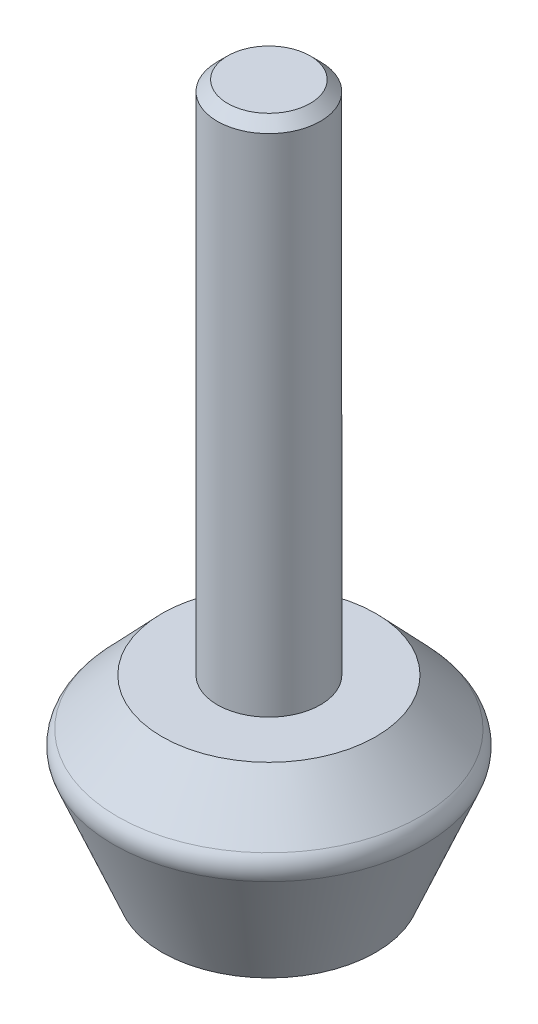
ISO-10303-21;
HEADER;
FILE_DESCRIPTION(('STEP AP214'),'2;1');
FILE_NAME('part.step','',(''),(''),'','','');
FILE_SCHEMA(('AUTOMOTIVE_DESIGN { 1 0 10303 214 1 1 1 1 }'));
ENDSEC;
DATA;
#1=APPLICATION_CONTEXT('core data for automotive mechanical design processes');
#2=APPLICATION_PROTOCOL_DEFINITION('international standard','automotive_design',2000,#1);
#3=PRODUCT_CONTEXT('',#1,'mechanical');
#4=PRODUCT('Part','Part','',(#3));
#5=PRODUCT_RELATED_PRODUCT_CATEGORY('part','',(#4));
#6=PRODUCT_DEFINITION_FORMATION('','',#4);
#7=PRODUCT_DEFINITION_CONTEXT('part definition',#1,'design');
#8=PRODUCT_DEFINITION('design','',#6,#7);
#9=PRODUCT_DEFINITION_SHAPE('','',#8);
#10=(LENGTH_UNIT() NAMED_UNIT(*) SI_UNIT(.MILLI.,.METRE.));
#11=(NAMED_UNIT(*) PLANE_ANGLE_UNIT() SI_UNIT($,.RADIAN.));
#12=(NAMED_UNIT(*) SI_UNIT($,.STERADIAN.) SOLID_ANGLE_UNIT());
#13=UNCERTAINTY_MEASURE_WITH_UNIT(LENGTH_MEASURE(1.E-05),#10,'distance_accuracy_value','');
#14=(GEOMETRIC_REPRESENTATION_CONTEXT(3) GLOBAL_UNCERTAINTY_ASSIGNED_CONTEXT((#13)) GLOBAL_UNIT_ASSIGNED_CONTEXT((#10,
#11,#12)) REPRESENTATION_CONTEXT('',''));
#15=CARTESIAN_POINT('',(0.,0.,0.));
#16=DIRECTION('',(0.,0.,1.));
#17=DIRECTION('',(1.,0.,0.));
#18=AXIS2_PLACEMENT_3D('',#15,#16,#17);
#19=CARTESIAN_POINT('',(0.,0.,0.));
#20=DIRECTION('',(0.,1.,0.));
#21=DIRECTION('',(0.,0.,1.));
#22=AXIS2_PLACEMENT_3D('',#19,#20,#21);
#23=PLANE('',#22);
#24=CARTESIAN_POINT('',(0.,0.,0.));
#25=DIRECTION('',(0.,1.,0.));
#26=DIRECTION('',(0.,0.,1.));
#27=AXIS2_PLACEMENT_3D('',#24,#25,#26);
#28=CIRCLE('',#27,5.18121795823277);
#29=CARTESIAN_POINT('',(0.,0.,5.18121795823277));
#30=VERTEX_POINT('',#29);
#31=EDGE_CURVE('E45',#30,#30,#28,.T.);
#32=ORIENTED_EDGE('',*,*,#31,.F.);
#33=EDGE_LOOP('',(#32));
#34=FACE_BOUND('',#33,.T.);
#35=ADVANCED_FACE('F26',(#34),#23,.F.);
#36=CARTESIAN_POINT('',(0.,0.,0.));
#37=DIRECTION('',(0.,1.,0.));
#38=DIRECTION('',(0.,0.,1.));
#39=AXIS2_PLACEMENT_3D('',#36,#37,#38);
#40=CONICAL_SURFACE('',#39,5.18121795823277,0.392033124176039);
#41=CARTESIAN_POINT('',(0.,5.71242893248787,0.));
#42=DIRECTION('',(0.,-1.,0.));
#43=DIRECTION('',(0.,0.,-1.));
#44=AXIS2_PLACEMENT_3D('',#41,#42,#43);
#45=CIRCLE('',#44,7.54292778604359);
#46=CARTESIAN_POINT('',(0.,5.71242893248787,-7.54292778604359));
#47=VERTEX_POINT('',#46);
#48=EDGE_CURVE('E36',#47,#47,#45,.T.);
#49=ORIENTED_EDGE('',*,*,#48,.T.);
#50=EDGE_LOOP('',(#49));
#51=FACE_BOUND('',#50,.T.);
#52=ORIENTED_EDGE('',*,*,#31,.T.);
#53=EDGE_LOOP('',(#52));
#54=FACE_BOUND('',#53,.T.);
#55=ADVANCED_FACE('F66',(#51,#54),#40,.T.);
#56=CARTESIAN_POINT('',(0.,6.31315248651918,0.));
#57=DIRECTION('',(0.,-1.,0.));
#58=DIRECTION('',(0.,0.,-1.));
#59=AXIS2_PLACEMENT_3D('',#56,#57,#58);
#60=CONICAL_SURFACE('',#59,7.79128706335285,0.760772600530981);
#61=CARTESIAN_POINT('',(0.,6.7839782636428,0.));
#62=DIRECTION('',(0.,1.,0.));
#63=DIRECTION('',(0.,0.,1.));
#64=AXIS2_PLACEMENT_3D('',#61,#62,#63);
#65=CIRCLE('',#64,7.34309714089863);
#66=CARTESIAN_POINT('',(0.,6.78397826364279,7.34309714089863));
#67=VERTEX_POINT('',#66);
#68=EDGE_CURVE('E40',#67,#67,#65,.T.);
#69=ORIENTED_EDGE('',*,*,#68,.T.);
#70=EDGE_LOOP('',(#69));
#71=FACE_BOUND('',#70,.T.);
#72=CARTESIAN_POINT('',(0.,9.055043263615,0.));
#73=DIRECTION('',(0.,1.,0.));
#74=DIRECTION('',(0.,0.,1.));
#75=AXIS2_PLACEMENT_3D('',#72,#73,#74);
#76=CIRCLE('',#75,5.18121795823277);
#77=CARTESIAN_POINT('',(0.,9.055043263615,5.18121795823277));
#78=VERTEX_POINT('',#77);
#79=EDGE_CURVE('E49',#78,#78,#76,.T.);
#80=ORIENTED_EDGE('',*,*,#79,.F.);
#81=EDGE_LOOP('',(#80));
#82=FACE_BOUND('',#81,.T.);
#83=ADVANCED_FACE('F61',(#71,#82),#60,.T.);
#84=CARTESIAN_POINT('',(5.18121795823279,9.05504326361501,0.));
#85=DIRECTION('',(0.,-1.,0.));
#86=DIRECTION('',(0.,0.,-1.));
#87=AXIS2_PLACEMENT_3D('',#84,#85,#86);
#88=PLANE('',#87);
#89=CARTESIAN_POINT('',(0.,9.055043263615,0.));
#90=DIRECTION('',(0.,1.,0.));
#91=DIRECTION('',(0.,0.,1.));
#92=AXIS2_PLACEMENT_3D('',#89,#90,#91);
#93=CIRCLE('',#92,2.50000000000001);
#94=CARTESIAN_POINT('',(0.,9.055043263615,2.50000000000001));
#95=VERTEX_POINT('',#94);
#96=EDGE_CURVE('E52',#95,#95,#93,.T.);
#97=ORIENTED_EDGE('',*,*,#96,.F.);
#98=EDGE_LOOP('',(#97));
#99=FACE_BOUND('',#98,.T.);
#100=ORIENTED_EDGE('',*,*,#79,.T.);
#101=EDGE_LOOP('',(#100));
#102=FACE_BOUND('',#101,.T.);
#103=ADVANCED_FACE('F58',(#99,#102),#88,.F.);
#104=CARTESIAN_POINT('',(0.,60.9390946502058,0.));
#105=DIRECTION('',(0.,1.,0.));
#106=DIRECTION('',(0.,0.,1.));
#107=AXIS2_PLACEMENT_3D('',#104,#105,#106);
#108=CYLINDRICAL_SURFACE('',#107,2.50000000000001);
#109=CARTESIAN_POINT('',(0.,33.555043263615,0.));
#110=DIRECTION('',(0.,-1.,0.));
#111=DIRECTION('',(0.,0.,-1.));
#112=AXIS2_PLACEMENT_3D('',#109,#110,#111);
#113=CIRCLE('',#112,2.50000000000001);
#114=CARTESIAN_POINT('',(0.,33.555043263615,-2.50000000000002));
#115=VERTEX_POINT('',#114);
#116=EDGE_CURVE('E10',#115,#115,#113,.T.);
#117=ORIENTED_EDGE('',*,*,#116,.T.);
#118=EDGE_LOOP('',(#117));
#119=FACE_BOUND('',#118,.T.);
#120=ORIENTED_EDGE('',*,*,#96,.T.);
#121=EDGE_LOOP('',(#120));
#122=FACE_BOUND('',#121,.T.);
#123=ADVANCED_FACE('F56',(#119,#122),#108,.T.);
#124=CARTESIAN_POINT('',(2.5,34.055043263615,0.));
#125=DIRECTION('',(0.,-1.,0.));
#126=DIRECTION('',(0.,0.,-1.));
#127=AXIS2_PLACEMENT_3D('',#124,#125,#126);
#128=PLANE('',#127);
#129=CARTESIAN_POINT('',(0.,34.055043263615,0.));
#130=DIRECTION('',(0.,-1.,0.));
#131=DIRECTION('',(0.,0.,-1.));
#132=AXIS2_PLACEMENT_3D('',#129,#130,#131);
#133=CIRCLE('',#132,2.);
#134=CARTESIAN_POINT('',(0.,34.055043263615,-2.00000000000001));
#135=VERTEX_POINT('',#134);
#136=EDGE_CURVE('E32',#135,#135,#133,.F.);
#137=ORIENTED_EDGE('',*,*,#136,.T.);
#138=EDGE_LOOP('',(#137));
#139=FACE_BOUND('',#138,.T.);
#140=ADVANCED_FACE('F96',(#139),#128,.F.);
#141=CARTESIAN_POINT('',(0.,6.09449701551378,0.));
#142=DIRECTION('',(0.,-1.,0.));
#143=DIRECTION('',(0.,0.,-1.));
#144=AXIS2_PLACEMENT_3D('',#141,#142,#143);
#145=TOROIDAL_SURFACE('',#144,6.61879360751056,1.);
#146=ORIENTED_EDGE('',*,*,#48,.F.);
#147=EDGE_LOOP('',(#146));
#148=FACE_BOUND('',#147,.T.);
#149=ORIENTED_EDGE('',*,*,#68,.F.);
#150=EDGE_LOOP('',(#149));
#151=FACE_BOUND('',#150,.T.);
#152=ADVANCED_FACE('F103',(#148,#151),#145,.T.);
#153=CARTESIAN_POINT('',(0.,34.055043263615,0.));
#154=DIRECTION('',(0.,-1.,0.));
#155=DIRECTION('',(0.,0.,-1.));
#156=AXIS2_PLACEMENT_3D('',#153,#154,#155);
#157=CONICAL_SURFACE('',#156,2.,0.785398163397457);
#158=ORIENTED_EDGE('',*,*,#116,.F.);
#159=EDGE_LOOP('',(#158));
#160=FACE_BOUND('',#159,.T.);
#161=ORIENTED_EDGE('',*,*,#136,.F.);
#162=EDGE_LOOP('',(#161));
#163=FACE_BOUND('',#162,.T.);
#164=ADVANCED_FACE('F110',(#160,#163),#157,.T.);
#165=CLOSED_SHELL('',(#35,#55,#83,#103,#123,#140,#152,#164));
#166=MANIFOLD_SOLID_BREP('B2',#165);
#167=ADVANCED_BREP_SHAPE_REPRESENTATION('',(#18,#166),#14);
#168=SHAPE_DEFINITION_REPRESENTATION(#9,#167);
ENDSEC;
END-ISO-10303-21;
